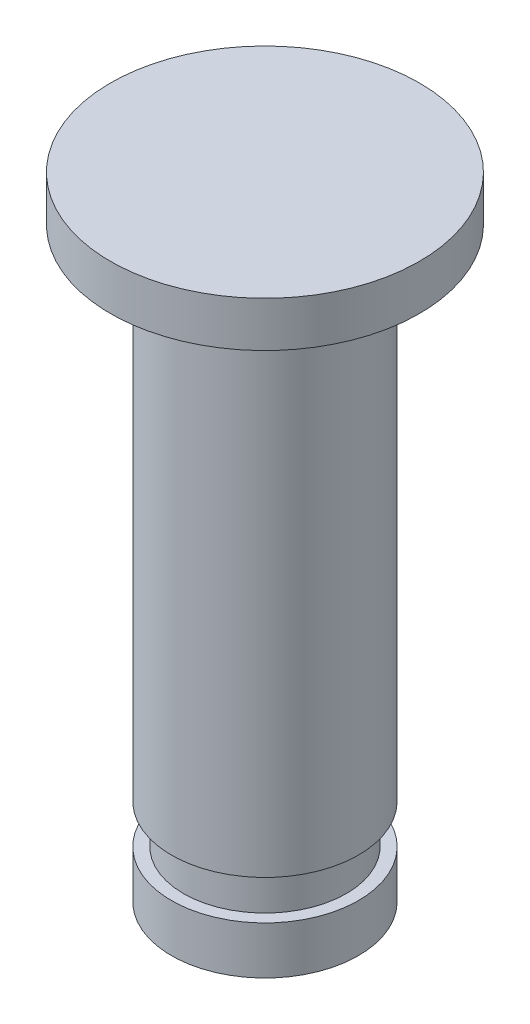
from build123d import *


with BuildPart() as part:
    # Esquisse1 → R_volution2 (revolve)
    with BuildSketch(Plane.XY, mode=Mode.PRIVATE) as r_volution2_sk:
        Polygon((0, 0), (3.14, 0), (3.14, -0.92), (1.9, -0.92), (1.9, -11.07), (1.655, -11.07), (1.655, -11.87), (1.9, -11.87), (1.9, -12.84), (0, -12.84), align=None)
    revolve(r_volution2_sk.sketch.rotate(Axis((0, -12.84, 0), (0, 1, 0)), 90), axis=Axis((0, -12.84, 0), (0, 1, 0)))


solid = part.part
